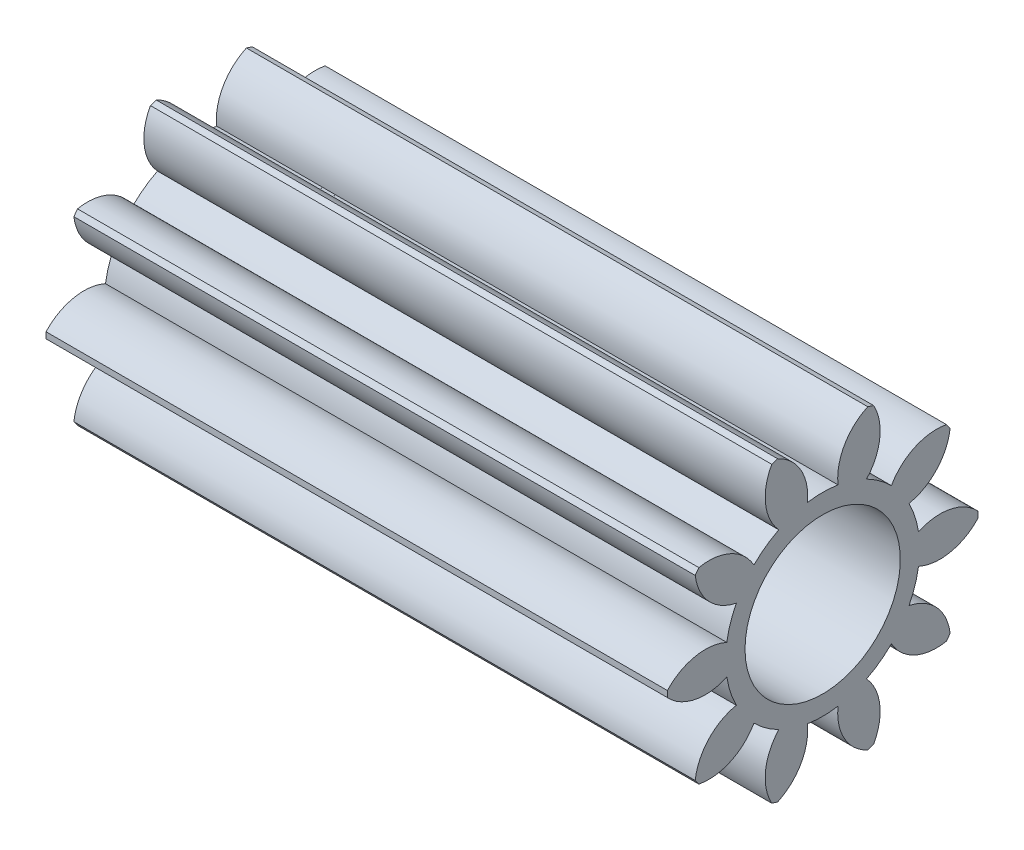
from build123d import *

# Parameters (mm, degrees)
BASPROSKE_W     = 12
BASPROSKE_H     = 3
TOOTHCUT_DEPTH  = 13.727922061
TEETHCUTS_COUNT = 10
TEETHCUTS_ANGLE = 324
BORSKE_R        = 1.5
BORE_DEPTH      = 50.0000508


with BuildPart() as part:
    # BasProSke → Base-Revolve (revolve)
    with BuildSketch(Plane(origin=(0, 0, 0), x_dir=(1, 0, 0), z_dir=(0, 1, 0)), mode=Mode.PRIVATE) as base_revolve_sk:
        with Locations((6, 1.5)):
            Rectangle(BASPROSKE_W, BASPROSKE_H)
    revolve(base_revolve_sk.sketch.rotate(Axis((-10, 0, 0), (1, 0, 0)), 180), axis=Axis((-10, 0, 0), (1, 0, 0)))

    # TooCutSke → ToothCut (cut, through all)
    with BuildSketch(Plane(origin=(0, 0, 0), x_dir=(0, 0, -1), z_dir=(1, 0, 0))):
        with BuildLine():
            ThreePointArc((0.296449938, 1.850403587), (0, 1.874), (-0.296449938, 1.850403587))
            ThreePointArc((-0.296449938, 1.850403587), (-0.428089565, 2.470295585), (-0.905889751, 2.886591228))
            ThreePointArc((-0.905889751, 2.886591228), (0, 3.0254), (0.905889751, 2.886591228))
            ThreePointArc((0.905889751, 2.886591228), (0.428089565, 2.470295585), (0.296449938, 1.850403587))
        make_face()
    toothcut = extrude(amount=TOOTHCUT_DEPTH, mode=Mode.SUBTRACT)

    # TeethCuts: ToothCut ×10 about axis
    teethcuts_axis = Axis((-10, 0, 0), (1, 0, 0))
    for i in range(1, TEETHCUTS_COUNT):
        add(toothcut.rotate(teethcuts_axis, i * TEETHCUTS_ANGLE / (TEETHCUTS_COUNT - 1)), mode=Mode.SUBTRACT)

    # BorSke → Bore (cut, symmetric)
    with BuildSketch(Plane(origin=(0, 0, 0), x_dir=(0, 0, -1), z_dir=(1, 0, 0))):
        with Locations(Location((0, 0, 0), (0, 0, 180))):
            Circle(BORSKE_R)
    extrude(amount=BORE_DEPTH, both=True, mode=Mode.SUBTRACT)


solid = part.part
